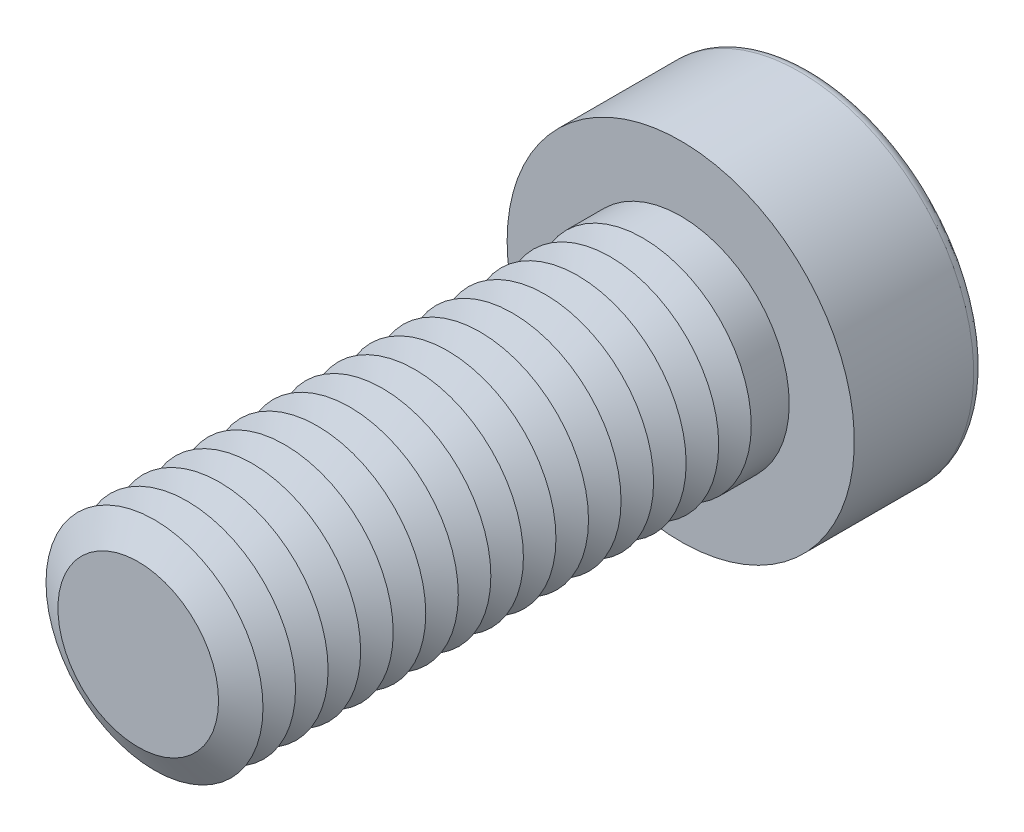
ISO-10303-21;
HEADER;
FILE_DESCRIPTION(('STEP AP214'),'2;1');
FILE_NAME('part.step','',(''),(''),'','','');
FILE_SCHEMA(('AUTOMOTIVE_DESIGN { 1 0 10303 214 1 1 1 1 }'));
ENDSEC;
DATA;
#1=APPLICATION_CONTEXT('core data for automotive mechanical design processes');
#2=APPLICATION_PROTOCOL_DEFINITION('international standard','automotive_design',2000,#1);
#3=PRODUCT_CONTEXT('',#1,'mechanical');
#4=PRODUCT('Part','Part','',(#3));
#5=PRODUCT_RELATED_PRODUCT_CATEGORY('part','',(#4));
#6=PRODUCT_DEFINITION_FORMATION('','',#4);
#7=PRODUCT_DEFINITION_CONTEXT('part definition',#1,'design');
#8=PRODUCT_DEFINITION('design','',#6,#7);
#9=PRODUCT_DEFINITION_SHAPE('','',#8);
#10=(LENGTH_UNIT() NAMED_UNIT(*) SI_UNIT(.MILLI.,.METRE.));
#11=(NAMED_UNIT(*) PLANE_ANGLE_UNIT() SI_UNIT($,.RADIAN.));
#12=(NAMED_UNIT(*) SI_UNIT($,.STERADIAN.) SOLID_ANGLE_UNIT());
#13=UNCERTAINTY_MEASURE_WITH_UNIT(LENGTH_MEASURE(1.E-05),#10,'distance_accuracy_value','');
#14=(GEOMETRIC_REPRESENTATION_CONTEXT(3) GLOBAL_UNCERTAINTY_ASSIGNED_CONTEXT((#13)) GLOBAL_UNIT_ASSIGNED_CONTEXT((#10,
#11,#12)) REPRESENTATION_CONTEXT('',''));
#15=CARTESIAN_POINT('',(0.,0.,0.));
#16=DIRECTION('',(0.,0.,1.));
#17=DIRECTION('',(1.,0.,0.));
#18=AXIS2_PLACEMENT_3D('',#15,#16,#17);
#19=CARTESIAN_POINT('',(0.,0.,19.75));
#20=DIRECTION('',(0.,0.,1.));
#21=DIRECTION('',(1.,0.,0.));
#22=AXIS2_PLACEMENT_3D('',#19,#20,#21);
#23=CONICAL_SURFACE('',#22,5.,1.0471975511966);
#24=CARTESIAN_POINT('',(0.,0.,19.));
#25=DIRECTION('',(0.,0.,1.));
#26=DIRECTION('',(1.,0.,0.));
#27=AXIS2_PLACEMENT_3D('',#24,#25,#26);
#28=CIRCLE('',#27,3.70096189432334);
#29=CARTESIAN_POINT('',(3.70096189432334,0.,19.));
#30=VERTEX_POINT('',#29);
#31=EDGE_CURVE('E313',#30,#30,#28,.T.);
#32=ORIENTED_EDGE('',*,*,#31,.T.);
#33=EDGE_LOOP('',(#32));
#34=FACE_BOUND('',#33,.T.);
#35=CARTESIAN_POINT('',(0.,0.,19.75));
#36=DIRECTION('',(0.,0.,1.));
#37=DIRECTION('',(1.,0.,0.));
#38=AXIS2_PLACEMENT_3D('',#35,#36,#37);
#39=CIRCLE('',#38,5.);
#40=CARTESIAN_POINT('',(5.,0.,19.75));
#41=VERTEX_POINT('',#40);
#42=EDGE_CURVE('E316',#41,#41,#39,.T.);
#43=ORIENTED_EDGE('',*,*,#42,.F.);
#44=EDGE_LOOP('',(#43));
#45=FACE_BOUND('',#44,.T.);
#46=ADVANCED_FACE('F38',(#34,#45),#23,.T.);
#47=CARTESIAN_POINT('',(0.,0.,19.));
#48=DIRECTION('',(0.,0.,-1.));
#49=DIRECTION('',(-1.,0.,0.));
#50=AXIS2_PLACEMENT_3D('',#47,#48,#49);
#51=CONICAL_SURFACE('',#50,3.70096189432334,1.0471975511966);
#52=CARTESIAN_POINT('',(0.,0.,18.25));
#53=DIRECTION('',(0.,0.,1.));
#54=DIRECTION('',(1.,0.,0.));
#55=AXIS2_PLACEMENT_3D('',#52,#53,#54);
#56=CIRCLE('',#55,5.);
#57=CARTESIAN_POINT('',(5.,0.,18.25));
#58=VERTEX_POINT('',#57);
#59=EDGE_CURVE('E324',#58,#58,#56,.T.);
#60=ORIENTED_EDGE('',*,*,#59,.T.);
#61=EDGE_LOOP('',(#60));
#62=FACE_BOUND('',#61,.T.);
#63=ORIENTED_EDGE('',*,*,#31,.F.);
#64=EDGE_LOOP('',(#63));
#65=FACE_BOUND('',#64,.T.);
#66=ADVANCED_FACE('F244',(#62,#65),#51,.T.);
#67=CARTESIAN_POINT('',(0.,0.,25.));
#68=DIRECTION('',(0.,0.,1.));
#69=DIRECTION('',(1.,0.,0.));
#70=AXIS2_PLACEMENT_3D('',#67,#68,#69);
#71=PLANE('',#70);
#72=CARTESIAN_POINT('',(0.,0.,25.));
#73=DIRECTION('',(0.,0.,1.));
#74=DIRECTION('',(1.,0.,0.));
#75=AXIS2_PLACEMENT_3D('',#72,#73,#74);
#76=CIRCLE('',#75,3.70096189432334);
#77=CARTESIAN_POINT('',(3.70096189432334,0.,25.));
#78=VERTEX_POINT('',#77);
#79=EDGE_CURVE('E173',#78,#78,#76,.T.);
#80=ORIENTED_EDGE('',*,*,#79,.T.);
#81=EDGE_LOOP('',(#80));
#82=FACE_BOUND('',#81,.T.);
#83=ADVANCED_FACE('F250',(#82),#71,.T.);
#84=CARTESIAN_POINT('',(0.,0.,25.));
#85=DIRECTION('',(0.,0.,-1.));
#86=DIRECTION('',(-1.,0.,0.));
#87=AXIS2_PLACEMENT_3D('',#84,#85,#86);
#88=CONICAL_SURFACE('',#87,3.70096189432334,1.0471975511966);
#89=CARTESIAN_POINT('',(0.,0.,24.25));
#90=DIRECTION('',(0.,0.,1.));
#91=DIRECTION('',(1.,0.,0.));
#92=AXIS2_PLACEMENT_3D('',#89,#90,#91);
#93=CIRCLE('',#92,5.);
#94=CARTESIAN_POINT('',(5.,0.,24.25));
#95=VERTEX_POINT('',#94);
#96=EDGE_CURVE('E290',#95,#95,#93,.T.);
#97=ORIENTED_EDGE('',*,*,#96,.T.);
#98=EDGE_LOOP('',(#97));
#99=FACE_BOUND('',#98,.T.);
#100=ORIENTED_EDGE('',*,*,#79,.F.);
#101=EDGE_LOOP('',(#100));
#102=FACE_BOUND('',#101,.T.);
#103=ADVANCED_FACE('F198',(#99,#102),#88,.T.);
#104=CARTESIAN_POINT('',(0.,0.,24.25));
#105=DIRECTION('',(0.,0.,1.));
#106=DIRECTION('',(1.,0.,0.));
#107=AXIS2_PLACEMENT_3D('',#104,#105,#106);
#108=CONICAL_SURFACE('',#107,5.,1.0471975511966);
#109=CARTESIAN_POINT('',(0.,0.,23.5));
#110=DIRECTION('',(0.,0.,1.));
#111=DIRECTION('',(1.,0.,0.));
#112=AXIS2_PLACEMENT_3D('',#109,#110,#111);
#113=CIRCLE('',#112,3.70096189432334);
#114=CARTESIAN_POINT('',(3.70096189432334,0.,23.5));
#115=VERTEX_POINT('',#114);
#116=EDGE_CURVE('E287',#115,#115,#113,.T.);
#117=ORIENTED_EDGE('',*,*,#116,.T.);
#118=EDGE_LOOP('',(#117));
#119=FACE_BOUND('',#118,.T.);
#120=ORIENTED_EDGE('',*,*,#96,.F.);
#121=EDGE_LOOP('',(#120));
#122=FACE_BOUND('',#121,.T.);
#123=ADVANCED_FACE('F276',(#119,#122),#108,.T.);
#124=CARTESIAN_POINT('',(0.,0.,23.5));
#125=DIRECTION('',(0.,0.,-1.));
#126=DIRECTION('',(-1.,0.,0.));
#127=AXIS2_PLACEMENT_3D('',#124,#125,#126);
#128=CONICAL_SURFACE('',#127,3.70096189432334,1.0471975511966);
#129=CARTESIAN_POINT('',(0.,0.,22.75));
#130=DIRECTION('',(0.,0.,1.));
#131=DIRECTION('',(1.,0.,0.));
#132=AXIS2_PLACEMENT_3D('',#129,#130,#131);
#133=CIRCLE('',#132,5.);
#134=CARTESIAN_POINT('',(5.,0.,22.75));
#135=VERTEX_POINT('',#134);
#136=EDGE_CURVE('E299',#135,#135,#133,.T.);
#137=ORIENTED_EDGE('',*,*,#136,.T.);
#138=EDGE_LOOP('',(#137));
#139=FACE_BOUND('',#138,.T.);
#140=ORIENTED_EDGE('',*,*,#116,.F.);
#141=EDGE_LOOP('',(#140));
#142=FACE_BOUND('',#141,.T.);
#143=ADVANCED_FACE('F273',(#139,#142),#128,.T.);
#144=CARTESIAN_POINT('',(0.,0.,22.75));
#145=DIRECTION('',(0.,0.,1.));
#146=DIRECTION('',(1.,0.,0.));
#147=AXIS2_PLACEMENT_3D('',#144,#145,#146);
#148=CONICAL_SURFACE('',#147,5.,1.0471975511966);
#149=CARTESIAN_POINT('',(0.,0.,22.));
#150=DIRECTION('',(0.,0.,1.));
#151=DIRECTION('',(1.,0.,0.));
#152=AXIS2_PLACEMENT_3D('',#149,#150,#151);
#153=CIRCLE('',#152,3.70096189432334);
#154=CARTESIAN_POINT('',(3.70096189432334,0.,22.));
#155=VERTEX_POINT('',#154);
#156=EDGE_CURVE('E292',#155,#155,#153,.T.);
#157=ORIENTED_EDGE('',*,*,#156,.T.);
#158=EDGE_LOOP('',(#157));
#159=FACE_BOUND('',#158,.T.);
#160=ORIENTED_EDGE('',*,*,#136,.F.);
#161=EDGE_LOOP('',(#160));
#162=FACE_BOUND('',#161,.T.);
#163=ADVANCED_FACE('F269',(#159,#162),#148,.T.);
#164=CARTESIAN_POINT('',(0.,0.,22.));
#165=DIRECTION('',(0.,0.,-1.));
#166=DIRECTION('',(-1.,0.,0.));
#167=AXIS2_PLACEMENT_3D('',#164,#165,#166);
#168=CONICAL_SURFACE('',#167,3.70096189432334,1.0471975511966);
#169=CARTESIAN_POINT('',(0.,0.,21.25));
#170=DIRECTION('',(0.,0.,1.));
#171=DIRECTION('',(1.,0.,0.));
#172=AXIS2_PLACEMENT_3D('',#169,#170,#171);
#173=CIRCLE('',#172,5.);
#174=CARTESIAN_POINT('',(5.,0.,21.25));
#175=VERTEX_POINT('',#174);
#176=EDGE_CURVE('E309',#175,#175,#173,.T.);
#177=ORIENTED_EDGE('',*,*,#176,.T.);
#178=EDGE_LOOP('',(#177));
#179=FACE_BOUND('',#178,.T.);
#180=ORIENTED_EDGE('',*,*,#156,.F.);
#181=EDGE_LOOP('',(#180));
#182=FACE_BOUND('',#181,.T.);
#183=ADVANCED_FACE('F265',(#179,#182),#168,.T.);
#184=CARTESIAN_POINT('',(0.,0.,21.25));
#185=DIRECTION('',(0.,0.,1.));
#186=DIRECTION('',(1.,0.,0.));
#187=AXIS2_PLACEMENT_3D('',#184,#185,#186);
#188=CONICAL_SURFACE('',#187,5.,1.0471975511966);
#189=CARTESIAN_POINT('',(0.,0.,20.5));
#190=DIRECTION('',(0.,0.,1.));
#191=DIRECTION('',(1.,0.,0.));
#192=AXIS2_PLACEMENT_3D('',#189,#190,#191);
#193=CIRCLE('',#192,3.70096189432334);
#194=CARTESIAN_POINT('',(3.70096189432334,0.,20.5));
#195=VERTEX_POINT('',#194);
#196=EDGE_CURVE('E305',#195,#195,#193,.T.);
#197=ORIENTED_EDGE('',*,*,#196,.T.);
#198=EDGE_LOOP('',(#197));
#199=FACE_BOUND('',#198,.T.);
#200=ORIENTED_EDGE('',*,*,#176,.F.);
#201=EDGE_LOOP('',(#200));
#202=FACE_BOUND('',#201,.T.);
#203=ADVANCED_FACE('F261',(#199,#202),#188,.T.);
#204=CARTESIAN_POINT('',(0.,0.,20.5));
#205=DIRECTION('',(0.,0.,-1.));
#206=DIRECTION('',(-1.,0.,0.));
#207=AXIS2_PLACEMENT_3D('',#204,#205,#206);
#208=CONICAL_SURFACE('',#207,3.70096189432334,1.0471975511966);
#209=ORIENTED_EDGE('',*,*,#42,.T.);
#210=EDGE_LOOP('',(#209));
#211=FACE_BOUND('',#210,.T.);
#212=ORIENTED_EDGE('',*,*,#196,.F.);
#213=EDGE_LOOP('',(#212));
#214=FACE_BOUND('',#213,.T.);
#215=ADVANCED_FACE('F257',(#211,#214),#208,.T.);
#216=CARTESIAN_POINT('',(0.,0.,18.25));
#217=DIRECTION('',(0.,0.,1.));
#218=DIRECTION('',(1.,0.,0.));
#219=AXIS2_PLACEMENT_3D('',#216,#217,#218);
#220=CONICAL_SURFACE('',#219,5.,1.0471975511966);
#221=CARTESIAN_POINT('',(0.,0.,17.5));
#222=DIRECTION('',(0.,0.,1.));
#223=DIRECTION('',(1.,0.,0.));
#224=AXIS2_PLACEMENT_3D('',#221,#222,#223);
#225=CIRCLE('',#224,3.70096189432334);
#226=CARTESIAN_POINT('',(3.70096189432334,0.,17.5));
#227=VERTEX_POINT('',#226);
#228=EDGE_CURVE('E320',#227,#227,#225,.T.);
#229=ORIENTED_EDGE('',*,*,#228,.T.);
#230=EDGE_LOOP('',(#229));
#231=FACE_BOUND('',#230,.T.);
#232=ORIENTED_EDGE('',*,*,#59,.F.);
#233=EDGE_LOOP('',(#232));
#234=FACE_BOUND('',#233,.T.);
#235=ADVANCED_FACE('F260',(#231,#234),#220,.T.);
#236=CARTESIAN_POINT('',(0.,0.,17.5));
#237=DIRECTION('',(0.,0.,-1.));
#238=DIRECTION('',(-1.,0.,0.));
#239=AXIS2_PLACEMENT_3D('',#236,#237,#238);
#240=CONICAL_SURFACE('',#239,3.70096189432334,1.0471975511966);
#241=CARTESIAN_POINT('',(0.,0.,16.75));
#242=DIRECTION('',(0.,0.,1.));
#243=DIRECTION('',(1.,0.,0.));
#244=AXIS2_PLACEMENT_3D('',#241,#242,#243);
#245=CIRCLE('',#244,5.);
#246=CARTESIAN_POINT('',(5.,0.,16.75));
#247=VERTEX_POINT('',#246);
#248=EDGE_CURVE('E332',#247,#247,#245,.T.);
#249=ORIENTED_EDGE('',*,*,#248,.T.);
#250=EDGE_LOOP('',(#249));
#251=FACE_BOUND('',#250,.T.);
#252=ORIENTED_EDGE('',*,*,#228,.F.);
#253=EDGE_LOOP('',(#252));
#254=FACE_BOUND('',#253,.T.);
#255=ADVANCED_FACE('F497',(#251,#254),#240,.T.);
#256=CARTESIAN_POINT('',(0.,0.,16.75));
#257=DIRECTION('',(0.,0.,1.));
#258=DIRECTION('',(1.,0.,0.));
#259=AXIS2_PLACEMENT_3D('',#256,#257,#258);
#260=CONICAL_SURFACE('',#259,5.,1.0471975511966);
#261=CARTESIAN_POINT('',(0.,0.,16.));
#262=DIRECTION('',(0.,0.,1.));
#263=DIRECTION('',(1.,0.,0.));
#264=AXIS2_PLACEMENT_3D('',#261,#262,#263);
#265=CIRCLE('',#264,3.70096189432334);
#266=CARTESIAN_POINT('',(3.70096189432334,0.,16.));
#267=VERTEX_POINT('',#266);
#268=EDGE_CURVE('E328',#267,#267,#265,.T.);
#269=ORIENTED_EDGE('',*,*,#268,.T.);
#270=EDGE_LOOP('',(#269));
#271=FACE_BOUND('',#270,.T.);
#272=ORIENTED_EDGE('',*,*,#248,.F.);
#273=EDGE_LOOP('',(#272));
#274=FACE_BOUND('',#273,.T.);
#275=ADVANCED_FACE('F493',(#271,#274),#260,.T.);
#276=CARTESIAN_POINT('',(0.,0.,16.));
#277=DIRECTION('',(0.,0.,-1.));
#278=DIRECTION('',(-1.,0.,0.));
#279=AXIS2_PLACEMENT_3D('',#276,#277,#278);
#280=CONICAL_SURFACE('',#279,3.70096189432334,1.0471975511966);
#281=CARTESIAN_POINT('',(0.,0.,15.25));
#282=DIRECTION('',(0.,0.,1.));
#283=DIRECTION('',(1.,0.,0.));
#284=AXIS2_PLACEMENT_3D('',#281,#282,#283);
#285=CIRCLE('',#284,5.);
#286=CARTESIAN_POINT('',(5.,0.,15.25));
#287=VERTEX_POINT('',#286);
#288=EDGE_CURVE('E340',#287,#287,#285,.T.);
#289=ORIENTED_EDGE('',*,*,#288,.T.);
#290=EDGE_LOOP('',(#289));
#291=FACE_BOUND('',#290,.T.);
#292=ORIENTED_EDGE('',*,*,#268,.F.);
#293=EDGE_LOOP('',(#292));
#294=FACE_BOUND('',#293,.T.);
#295=ADVANCED_FACE('F489',(#291,#294),#280,.T.);
#296=CARTESIAN_POINT('',(0.,0.,15.25));
#297=DIRECTION('',(0.,0.,1.));
#298=DIRECTION('',(1.,0.,0.));
#299=AXIS2_PLACEMENT_3D('',#296,#297,#298);
#300=CONICAL_SURFACE('',#299,5.,1.0471975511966);
#301=CARTESIAN_POINT('',(0.,0.,14.5));
#302=DIRECTION('',(0.,0.,1.));
#303=DIRECTION('',(1.,0.,0.));
#304=AXIS2_PLACEMENT_3D('',#301,#302,#303);
#305=CIRCLE('',#304,3.70096189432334);
#306=CARTESIAN_POINT('',(3.70096189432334,0.,14.5));
#307=VERTEX_POINT('',#306);
#308=EDGE_CURVE('E336',#307,#307,#305,.T.);
#309=ORIENTED_EDGE('',*,*,#308,.T.);
#310=EDGE_LOOP('',(#309));
#311=FACE_BOUND('',#310,.T.);
#312=ORIENTED_EDGE('',*,*,#288,.F.);
#313=EDGE_LOOP('',(#312));
#314=FACE_BOUND('',#313,.T.);
#315=ADVANCED_FACE('F485',(#311,#314),#300,.T.);
#316=CARTESIAN_POINT('',(0.,0.,14.5));
#317=DIRECTION('',(0.,0.,-1.));
#318=DIRECTION('',(-1.,0.,0.));
#319=AXIS2_PLACEMENT_3D('',#316,#317,#318);
#320=CONICAL_SURFACE('',#319,3.70096189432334,1.0471975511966);
#321=CARTESIAN_POINT('',(0.,0.,13.75));
#322=DIRECTION('',(0.,0.,1.));
#323=DIRECTION('',(1.,0.,0.));
#324=AXIS2_PLACEMENT_3D('',#321,#322,#323);
#325=CIRCLE('',#324,5.);
#326=CARTESIAN_POINT('',(5.,0.,13.75));
#327=VERTEX_POINT('',#326);
#328=EDGE_CURVE('E348',#327,#327,#325,.T.);
#329=ORIENTED_EDGE('',*,*,#328,.T.);
#330=EDGE_LOOP('',(#329));
#331=FACE_BOUND('',#330,.T.);
#332=ORIENTED_EDGE('',*,*,#308,.F.);
#333=EDGE_LOOP('',(#332));
#334=FACE_BOUND('',#333,.T.);
#335=ADVANCED_FACE('F481',(#331,#334),#320,.T.);
#336=CARTESIAN_POINT('',(0.,0.,13.75));
#337=DIRECTION('',(0.,0.,1.));
#338=DIRECTION('',(1.,0.,0.));
#339=AXIS2_PLACEMENT_3D('',#336,#337,#338);
#340=CONICAL_SURFACE('',#339,5.,1.0471975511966);
#341=CARTESIAN_POINT('',(0.,0.,13.));
#342=DIRECTION('',(0.,0.,1.));
#343=DIRECTION('',(1.,0.,0.));
#344=AXIS2_PLACEMENT_3D('',#341,#342,#343);
#345=CIRCLE('',#344,3.70096189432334);
#346=CARTESIAN_POINT('',(3.70096189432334,0.,13.));
#347=VERTEX_POINT('',#346);
#348=EDGE_CURVE('E344',#347,#347,#345,.T.);
#349=ORIENTED_EDGE('',*,*,#348,.T.);
#350=EDGE_LOOP('',(#349));
#351=FACE_BOUND('',#350,.T.);
#352=ORIENTED_EDGE('',*,*,#328,.F.);
#353=EDGE_LOOP('',(#352));
#354=FACE_BOUND('',#353,.T.);
#355=ADVANCED_FACE('F477',(#351,#354),#340,.T.);
#356=CARTESIAN_POINT('',(0.,0.,13.));
#357=DIRECTION('',(0.,0.,-1.));
#358=DIRECTION('',(-1.,0.,0.));
#359=AXIS2_PLACEMENT_3D('',#356,#357,#358);
#360=CONICAL_SURFACE('',#359,3.70096189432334,1.0471975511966);
#361=CARTESIAN_POINT('',(0.,0.,12.25));
#362=DIRECTION('',(0.,0.,1.));
#363=DIRECTION('',(1.,0.,0.));
#364=AXIS2_PLACEMENT_3D('',#361,#362,#363);
#365=CIRCLE('',#364,5.);
#366=CARTESIAN_POINT('',(5.,0.,12.25));
#367=VERTEX_POINT('',#366);
#368=EDGE_CURVE('E356',#367,#367,#365,.T.);
#369=ORIENTED_EDGE('',*,*,#368,.T.);
#370=EDGE_LOOP('',(#369));
#371=FACE_BOUND('',#370,.T.);
#372=ORIENTED_EDGE('',*,*,#348,.F.);
#373=EDGE_LOOP('',(#372));
#374=FACE_BOUND('',#373,.T.);
#375=ADVANCED_FACE('F473',(#371,#374),#360,.T.);
#376=CARTESIAN_POINT('',(0.,0.,12.25));
#377=DIRECTION('',(0.,0.,1.));
#378=DIRECTION('',(1.,0.,0.));
#379=AXIS2_PLACEMENT_3D('',#376,#377,#378);
#380=CONICAL_SURFACE('',#379,5.,1.0471975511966);
#381=CARTESIAN_POINT('',(0.,0.,11.5));
#382=DIRECTION('',(0.,0.,1.));
#383=DIRECTION('',(1.,0.,0.));
#384=AXIS2_PLACEMENT_3D('',#381,#382,#383);
#385=CIRCLE('',#384,3.70096189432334);
#386=CARTESIAN_POINT('',(3.70096189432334,0.,11.5));
#387=VERTEX_POINT('',#386);
#388=EDGE_CURVE('E352',#387,#387,#385,.T.);
#389=ORIENTED_EDGE('',*,*,#388,.T.);
#390=EDGE_LOOP('',(#389));
#391=FACE_BOUND('',#390,.T.);
#392=ORIENTED_EDGE('',*,*,#368,.F.);
#393=EDGE_LOOP('',(#392));
#394=FACE_BOUND('',#393,.T.);
#395=ADVANCED_FACE('F469',(#391,#394),#380,.T.);
#396=CARTESIAN_POINT('',(0.,0.,11.5));
#397=DIRECTION('',(0.,0.,-1.));
#398=DIRECTION('',(-1.,0.,0.));
#399=AXIS2_PLACEMENT_3D('',#396,#397,#398);
#400=CONICAL_SURFACE('',#399,3.70096189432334,1.0471975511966);
#401=CARTESIAN_POINT('',(0.,0.,10.75));
#402=DIRECTION('',(0.,0.,1.));
#403=DIRECTION('',(1.,0.,0.));
#404=AXIS2_PLACEMENT_3D('',#401,#402,#403);
#405=CIRCLE('',#404,5.);
#406=CARTESIAN_POINT('',(5.,0.,10.75));
#407=VERTEX_POINT('',#406);
#408=EDGE_CURVE('E364',#407,#407,#405,.T.);
#409=ORIENTED_EDGE('',*,*,#408,.T.);
#410=EDGE_LOOP('',(#409));
#411=FACE_BOUND('',#410,.T.);
#412=ORIENTED_EDGE('',*,*,#388,.F.);
#413=EDGE_LOOP('',(#412));
#414=FACE_BOUND('',#413,.T.);
#415=ADVANCED_FACE('F465',(#411,#414),#400,.T.);
#416=CARTESIAN_POINT('',(0.,0.,10.75));
#417=DIRECTION('',(0.,0.,1.));
#418=DIRECTION('',(1.,0.,0.));
#419=AXIS2_PLACEMENT_3D('',#416,#417,#418);
#420=CONICAL_SURFACE('',#419,5.,1.0471975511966);
#421=CARTESIAN_POINT('',(0.,0.,10.));
#422=DIRECTION('',(0.,0.,1.));
#423=DIRECTION('',(1.,0.,0.));
#424=AXIS2_PLACEMENT_3D('',#421,#422,#423);
#425=CIRCLE('',#424,3.70096189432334);
#426=CARTESIAN_POINT('',(3.70096189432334,0.,10.));
#427=VERTEX_POINT('',#426);
#428=EDGE_CURVE('E360',#427,#427,#425,.T.);
#429=ORIENTED_EDGE('',*,*,#428,.T.);
#430=EDGE_LOOP('',(#429));
#431=FACE_BOUND('',#430,.T.);
#432=ORIENTED_EDGE('',*,*,#408,.F.);
#433=EDGE_LOOP('',(#432));
#434=FACE_BOUND('',#433,.T.);
#435=ADVANCED_FACE('F461',(#431,#434),#420,.T.);
#436=CARTESIAN_POINT('',(0.,0.,10.));
#437=DIRECTION('',(0.,0.,-1.));
#438=DIRECTION('',(-1.,0.,0.));
#439=AXIS2_PLACEMENT_3D('',#436,#437,#438);
#440=CONICAL_SURFACE('',#439,3.70096189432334,1.0471975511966);
#441=CARTESIAN_POINT('',(0.,0.,9.25));
#442=DIRECTION('',(0.,0.,1.));
#443=DIRECTION('',(1.,0.,0.));
#444=AXIS2_PLACEMENT_3D('',#441,#442,#443);
#445=CIRCLE('',#444,5.);
#446=CARTESIAN_POINT('',(5.,0.,9.25));
#447=VERTEX_POINT('',#446);
#448=EDGE_CURVE('E372',#447,#447,#445,.T.);
#449=ORIENTED_EDGE('',*,*,#448,.T.);
#450=EDGE_LOOP('',(#449));
#451=FACE_BOUND('',#450,.T.);
#452=ORIENTED_EDGE('',*,*,#428,.F.);
#453=EDGE_LOOP('',(#452));
#454=FACE_BOUND('',#453,.T.);
#455=ADVANCED_FACE('F457',(#451,#454),#440,.T.);
#456=CARTESIAN_POINT('',(0.,0.,9.25));
#457=DIRECTION('',(0.,0.,1.));
#458=DIRECTION('',(1.,0.,0.));
#459=AXIS2_PLACEMENT_3D('',#456,#457,#458);
#460=CONICAL_SURFACE('',#459,5.,1.0471975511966);
#461=CARTESIAN_POINT('',(0.,0.,8.5));
#462=DIRECTION('',(0.,0.,1.));
#463=DIRECTION('',(1.,0.,0.));
#464=AXIS2_PLACEMENT_3D('',#461,#462,#463);
#465=CIRCLE('',#464,3.70096189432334);
#466=CARTESIAN_POINT('',(3.70096189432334,0.,8.5));
#467=VERTEX_POINT('',#466);
#468=EDGE_CURVE('E368',#467,#467,#465,.T.);
#469=ORIENTED_EDGE('',*,*,#468,.T.);
#470=EDGE_LOOP('',(#469));
#471=FACE_BOUND('',#470,.T.);
#472=ORIENTED_EDGE('',*,*,#448,.F.);
#473=EDGE_LOOP('',(#472));
#474=FACE_BOUND('',#473,.T.);
#475=ADVANCED_FACE('F453',(#471,#474),#460,.T.);
#476=CARTESIAN_POINT('',(0.,0.,8.5));
#477=DIRECTION('',(0.,0.,-1.));
#478=DIRECTION('',(-1.,0.,0.));
#479=AXIS2_PLACEMENT_3D('',#476,#477,#478);
#480=CONICAL_SURFACE('',#479,3.70096189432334,1.0471975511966);
#481=CARTESIAN_POINT('',(0.,0.,7.75));
#482=DIRECTION('',(0.,0.,1.));
#483=DIRECTION('',(1.,0.,0.));
#484=AXIS2_PLACEMENT_3D('',#481,#482,#483);
#485=CIRCLE('',#484,5.);
#486=CARTESIAN_POINT('',(5.,0.,7.75));
#487=VERTEX_POINT('',#486);
#488=EDGE_CURVE('E380',#487,#487,#485,.T.);
#489=ORIENTED_EDGE('',*,*,#488,.T.);
#490=EDGE_LOOP('',(#489));
#491=FACE_BOUND('',#490,.T.);
#492=ORIENTED_EDGE('',*,*,#468,.F.);
#493=EDGE_LOOP('',(#492));
#494=FACE_BOUND('',#493,.T.);
#495=ADVANCED_FACE('F449',(#491,#494),#480,.T.);
#496=CARTESIAN_POINT('',(0.,0.,7.75));
#497=DIRECTION('',(0.,0.,1.));
#498=DIRECTION('',(1.,0.,0.));
#499=AXIS2_PLACEMENT_3D('',#496,#497,#498);
#500=CONICAL_SURFACE('',#499,5.,1.0471975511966);
#501=CARTESIAN_POINT('',(0.,0.,7.));
#502=DIRECTION('',(0.,0.,1.));
#503=DIRECTION('',(1.,0.,0.));
#504=AXIS2_PLACEMENT_3D('',#501,#502,#503);
#505=CIRCLE('',#504,3.70096189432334);
#506=CARTESIAN_POINT('',(3.70096189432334,0.,7.));
#507=VERTEX_POINT('',#506);
#508=EDGE_CURVE('E376',#507,#507,#505,.T.);
#509=ORIENTED_EDGE('',*,*,#508,.T.);
#510=EDGE_LOOP('',(#509));
#511=FACE_BOUND('',#510,.T.);
#512=ORIENTED_EDGE('',*,*,#488,.F.);
#513=EDGE_LOOP('',(#512));
#514=FACE_BOUND('',#513,.T.);
#515=ADVANCED_FACE('F445',(#511,#514),#500,.T.);
#516=CARTESIAN_POINT('',(0.,0.,7.));
#517=DIRECTION('',(0.,0.,-1.));
#518=DIRECTION('',(-1.,0.,0.));
#519=AXIS2_PLACEMENT_3D('',#516,#517,#518);
#520=CONICAL_SURFACE('',#519,3.70096189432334,1.0471975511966);
#521=CARTESIAN_POINT('',(0.,0.,6.25));
#522=DIRECTION('',(0.,0.,1.));
#523=DIRECTION('',(1.,0.,0.));
#524=AXIS2_PLACEMENT_3D('',#521,#522,#523);
#525=CIRCLE('',#524,5.);
#526=CARTESIAN_POINT('',(5.,0.,6.25));
#527=VERTEX_POINT('',#526);
#528=EDGE_CURVE('E388',#527,#527,#525,.T.);
#529=ORIENTED_EDGE('',*,*,#528,.T.);
#530=EDGE_LOOP('',(#529));
#531=FACE_BOUND('',#530,.T.);
#532=ORIENTED_EDGE('',*,*,#508,.F.);
#533=EDGE_LOOP('',(#532));
#534=FACE_BOUND('',#533,.T.);
#535=ADVANCED_FACE('F441',(#531,#534),#520,.T.);
#536=CARTESIAN_POINT('',(0.,0.,6.25));
#537=DIRECTION('',(0.,0.,1.));
#538=DIRECTION('',(1.,0.,0.));
#539=AXIS2_PLACEMENT_3D('',#536,#537,#538);
#540=CONICAL_SURFACE('',#539,5.,1.0471975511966);
#541=CARTESIAN_POINT('',(0.,0.,5.5));
#542=DIRECTION('',(0.,0.,1.));
#543=DIRECTION('',(1.,0.,0.));
#544=AXIS2_PLACEMENT_3D('',#541,#542,#543);
#545=CIRCLE('',#544,3.70096189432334);
#546=CARTESIAN_POINT('',(3.70096189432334,0.,5.5));
#547=VERTEX_POINT('',#546);
#548=EDGE_CURVE('E384',#547,#547,#545,.T.);
#549=ORIENTED_EDGE('',*,*,#548,.T.);
#550=EDGE_LOOP('',(#549));
#551=FACE_BOUND('',#550,.T.);
#552=ORIENTED_EDGE('',*,*,#528,.F.);
#553=EDGE_LOOP('',(#552));
#554=FACE_BOUND('',#553,.T.);
#555=ADVANCED_FACE('F437',(#551,#554),#540,.T.);
#556=CARTESIAN_POINT('',(0.,0.,5.5));
#557=DIRECTION('',(0.,0.,-1.));
#558=DIRECTION('',(-1.,0.,0.));
#559=AXIS2_PLACEMENT_3D('',#556,#557,#558);
#560=CONICAL_SURFACE('',#559,3.70096189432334,1.0471975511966);
#561=CARTESIAN_POINT('',(0.,0.,4.75));
#562=DIRECTION('',(0.,0.,1.));
#563=DIRECTION('',(1.,0.,0.));
#564=AXIS2_PLACEMENT_3D('',#561,#562,#563);
#565=CIRCLE('',#564,5.);
#566=CARTESIAN_POINT('',(5.,0.,4.75));
#567=VERTEX_POINT('',#566);
#568=EDGE_CURVE('E396',#567,#567,#565,.T.);
#569=ORIENTED_EDGE('',*,*,#568,.T.);
#570=EDGE_LOOP('',(#569));
#571=FACE_BOUND('',#570,.T.);
#572=ORIENTED_EDGE('',*,*,#548,.F.);
#573=EDGE_LOOP('',(#572));
#574=FACE_BOUND('',#573,.T.);
#575=ADVANCED_FACE('F433',(#571,#574),#560,.T.);
#576=CARTESIAN_POINT('',(0.,0.,4.75));
#577=DIRECTION('',(0.,0.,1.));
#578=DIRECTION('',(1.,0.,0.));
#579=AXIS2_PLACEMENT_3D('',#576,#577,#578);
#580=CONICAL_SURFACE('',#579,5.,1.0471975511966);
#581=CARTESIAN_POINT('',(0.,0.,4.));
#582=DIRECTION('',(0.,0.,1.));
#583=DIRECTION('',(1.,0.,0.));
#584=AXIS2_PLACEMENT_3D('',#581,#582,#583);
#585=CIRCLE('',#584,3.70096189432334);
#586=CARTESIAN_POINT('',(3.70096189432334,0.,4.));
#587=VERTEX_POINT('',#586);
#588=EDGE_CURVE('E392',#587,#587,#585,.T.);
#589=ORIENTED_EDGE('',*,*,#588,.T.);
#590=EDGE_LOOP('',(#589));
#591=FACE_BOUND('',#590,.T.);
#592=ORIENTED_EDGE('',*,*,#568,.F.);
#593=EDGE_LOOP('',(#592));
#594=FACE_BOUND('',#593,.T.);
#595=ADVANCED_FACE('F428',(#591,#594),#580,.T.);
#596=CARTESIAN_POINT('',(0.,0.,4.));
#597=DIRECTION('',(0.,0.,-1.));
#598=DIRECTION('',(-1.,0.,0.));
#599=AXIS2_PLACEMENT_3D('',#596,#597,#598);
#600=CONICAL_SURFACE('',#599,3.70096189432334,1.0471975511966);
#601=CARTESIAN_POINT('',(0.,0.,3.25));
#602=DIRECTION('',(0.,0.,1.));
#603=DIRECTION('',(1.,0.,0.));
#604=AXIS2_PLACEMENT_3D('',#601,#602,#603);
#605=CIRCLE('',#604,5.);
#606=CARTESIAN_POINT('',(5.,0.,3.25));
#607=VERTEX_POINT('',#606);
#608=EDGE_CURVE('E408',#607,#607,#605,.T.);
#609=ORIENTED_EDGE('',*,*,#608,.T.);
#610=EDGE_LOOP('',(#609));
#611=FACE_BOUND('',#610,.T.);
#612=ORIENTED_EDGE('',*,*,#588,.F.);
#613=EDGE_LOOP('',(#612));
#614=FACE_BOUND('',#613,.T.);
#615=ADVANCED_FACE('F414',(#611,#614),#600,.T.);
#616=CARTESIAN_POINT('',(0.,0.,3.25));
#617=DIRECTION('',(0.,0.,1.));
#618=DIRECTION('',(1.,0.,0.));
#619=AXIS2_PLACEMENT_3D('',#616,#617,#618);
#620=CONICAL_SURFACE('',#619,5.,1.0471975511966);
#621=CARTESIAN_POINT('',(0.,0.,2.5));
#622=DIRECTION('',(0.,0.,1.));
#623=DIRECTION('',(1.,0.,0.));
#624=AXIS2_PLACEMENT_3D('',#621,#622,#623);
#625=CIRCLE('',#624,3.70096189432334);
#626=CARTESIAN_POINT('',(3.70096189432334,0.,2.5));
#627=VERTEX_POINT('',#626);
#628=EDGE_CURVE('E400',#627,#627,#625,.T.);
#629=ORIENTED_EDGE('',*,*,#628,.T.);
#630=EDGE_LOOP('',(#629));
#631=FACE_BOUND('',#630,.T.);
#632=ORIENTED_EDGE('',*,*,#608,.F.);
#633=EDGE_LOOP('',(#632));
#634=FACE_BOUND('',#633,.T.);
#635=ADVANCED_FACE('F417',(#631,#634),#620,.T.);
#636=CARTESIAN_POINT('',(0.,0.,2.5));
#637=DIRECTION('',(0.,0.,-1.));
#638=DIRECTION('',(-1.,0.,0.));
#639=AXIS2_PLACEMENT_3D('',#636,#637,#638);
#640=CONICAL_SURFACE('',#639,3.70096189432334,1.0471975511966);
#641=CARTESIAN_POINT('',(0.,0.,1.75));
#642=DIRECTION('',(0.,0.,1.));
#643=DIRECTION('',(1.,0.,0.));
#644=AXIS2_PLACEMENT_3D('',#641,#642,#643);
#645=CIRCLE('',#644,5.);
#646=CARTESIAN_POINT('',(5.,0.,1.75));
#647=VERTEX_POINT('',#646);
#648=EDGE_CURVE('E404',#647,#647,#645,.T.);
#649=ORIENTED_EDGE('',*,*,#648,.T.);
#650=EDGE_LOOP('',(#649));
#651=FACE_BOUND('',#650,.T.);
#652=ORIENTED_EDGE('',*,*,#628,.F.);
#653=EDGE_LOOP('',(#652));
#654=FACE_BOUND('',#653,.T.);
#655=ADVANCED_FACE('F419',(#651,#654),#640,.T.);
#656=CARTESIAN_POINT('',(0.,0.,-0.75));
#657=DIRECTION('',(0.,0.,-1.));
#658=DIRECTION('',(-1.,0.,0.));
#659=AXIS2_PLACEMENT_3D('',#656,#657,#658);
#660=CONICAL_SURFACE('',#659,3.5,1.0471975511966);
#661=CARTESIAN_POINT('',(0.,0.,1.27072594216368));
#662=VERTEX_POINT('',#661);
#663=VERTEX_LOOP('',#662);
#664=FACE_BOUND('',#663,.T.);
#665=CARTESIAN_POINT('',(0.,0.,-0.75));
#666=DIRECTION('',(0.,0.,-1.));
#667=DIRECTION('',(-1.,0.,0.));
#668=AXIS2_PLACEMENT_3D('',#665,#666,#667);
#669=CIRCLE('',#668,3.5);
#670=CARTESIAN_POINT('',(-3.03108891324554,1.75,-0.75));
#671=VERTEX_POINT('',#670);
#672=CARTESIAN_POINT('',(0.,3.5,-0.75));
#673=VERTEX_POINT('',#672);
#674=EDGE_CURVE('E148',#671,#673,#669,.T.);
#675=ORIENTED_EDGE('',*,*,#674,.T.);
#676=CARTESIAN_POINT('',(0.,0.,-0.75));
#677=DIRECTION('',(0.,0.,-1.));
#678=DIRECTION('',(-1.,0.,0.));
#679=AXIS2_PLACEMENT_3D('',#676,#677,#678);
#680=CIRCLE('',#679,3.5);
#681=CARTESIAN_POINT('',(3.03108891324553,1.75,-0.75));
#682=VERTEX_POINT('',#681);
#683=EDGE_CURVE('E53',#673,#682,#680,.T.);
#684=ORIENTED_EDGE('',*,*,#683,.T.);
#685=CARTESIAN_POINT('',(3.03108891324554,-1.75,-0.75));
#686=VERTEX_POINT('',#685);
#687=EDGE_CURVE('E1000',#682,#686,#680,.T.);
#688=ORIENTED_EDGE('',*,*,#687,.T.);
#689=CARTESIAN_POINT('',(0.,-3.5,-0.75));
#690=VERTEX_POINT('',#689);
#691=EDGE_CURVE('E998',#686,#690,#680,.T.);
#692=ORIENTED_EDGE('',*,*,#691,.T.);
#693=CARTESIAN_POINT('',(-3.03108891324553,-1.75,-0.75));
#694=VERTEX_POINT('',#693);
#695=EDGE_CURVE('E992',#690,#694,#680,.T.);
#696=ORIENTED_EDGE('',*,*,#695,.T.);
#697=EDGE_CURVE('E990',#694,#671,#680,.T.);
#698=ORIENTED_EDGE('',*,*,#697,.T.);
#699=EDGE_LOOP('',(#675,#684,#688,#692,#696,#698));
#700=FACE_BOUND('',#699,.T.);
#701=ADVANCED_FACE('F200',(#664,#700),#660,.F.);
#702=CARTESIAN_POINT('',(0.,0.,-0.75));
#703=DIRECTION('',(0.,0.,-1.));
#704=DIRECTION('',(-1.,0.,0.));
#705=AXIS2_PLACEMENT_3D('',#702,#703,#704);
#706=PLANE('',#705);
#707=ORIENTED_EDGE('',*,*,#683,.F.);
#708=DIRECTION('',(1.,0.,0.));
#709=VECTOR('',#708,1.);
#710=CARTESIAN_POINT('',(-2.02072594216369,3.5,-0.75));
#711=LINE('',#710,#709);
#712=CARTESIAN_POINT('',(2.02072594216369,3.5,-0.75));
#713=VERTEX_POINT('',#712);
#714=EDGE_CURVE('E1039',#673,#713,#711,.T.);
#715=ORIENTED_EDGE('',*,*,#714,.T.);
#716=DIRECTION('',(0.5,-0.866025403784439,0.));
#717=VECTOR('',#716,1.);
#718=CARTESIAN_POINT('',(2.02072594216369,3.5,-0.75));
#719=LINE('',#718,#717);
#720=EDGE_CURVE('E154',#713,#682,#719,.T.);
#721=ORIENTED_EDGE('',*,*,#720,.T.);
#722=EDGE_LOOP('',(#707,#715,#721));
#723=FACE_BOUND('',#722,.T.);
#724=ADVANCED_FACE('F586',(#723),#706,.T.);
#725=ORIENTED_EDGE('',*,*,#687,.F.);
#726=CARTESIAN_POINT('',(4.04145188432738,0.,-0.75));
#727=VERTEX_POINT('',#726);
#728=EDGE_CURVE('E1033',#682,#727,#719,.T.);
#729=ORIENTED_EDGE('',*,*,#728,.T.);
#730=DIRECTION('',(-0.5,-0.866025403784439,0.));
#731=VECTOR('',#730,1.);
#732=CARTESIAN_POINT('',(4.04145188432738,0.,-0.75));
#733=LINE('',#732,#731);
#734=EDGE_CURVE('E1011',#727,#686,#733,.T.);
#735=ORIENTED_EDGE('',*,*,#734,.T.);
#736=EDGE_LOOP('',(#725,#729,#735));
#737=FACE_BOUND('',#736,.T.);
#738=ADVANCED_FACE('F596',(#737),#706,.T.);
#739=ORIENTED_EDGE('',*,*,#691,.F.);
#740=CARTESIAN_POINT('',(2.02072594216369,-3.5,-0.75));
#741=VERTEX_POINT('',#740);
#742=EDGE_CURVE('E1013',#686,#741,#733,.T.);
#743=ORIENTED_EDGE('',*,*,#742,.T.);
#744=DIRECTION('',(-1.,0.,0.));
#745=VECTOR('',#744,1.);
#746=CARTESIAN_POINT('',(2.02072594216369,-3.5,-0.75));
#747=LINE('',#746,#745);
#748=EDGE_CURVE('E963',#741,#690,#747,.T.);
#749=ORIENTED_EDGE('',*,*,#748,.T.);
#750=EDGE_LOOP('',(#739,#743,#749));
#751=FACE_BOUND('',#750,.T.);
#752=ADVANCED_FACE('F606',(#751),#706,.T.);
#753=ORIENTED_EDGE('',*,*,#695,.F.);
#754=CARTESIAN_POINT('',(-2.02072594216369,-3.5,-0.75));
#755=VERTEX_POINT('',#754);
#756=EDGE_CURVE('E1008',#690,#755,#747,.T.);
#757=ORIENTED_EDGE('',*,*,#756,.T.);
#758=DIRECTION('',(-0.5,0.866025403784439,0.));
#759=VECTOR('',#758,1.);
#760=CARTESIAN_POINT('',(-2.02072594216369,-3.5,-0.75));
#761=LINE('',#760,#759);
#762=EDGE_CURVE('E1010',#755,#694,#761,.T.);
#763=ORIENTED_EDGE('',*,*,#762,.T.);
#764=EDGE_LOOP('',(#753,#757,#763));
#765=FACE_BOUND('',#764,.T.);
#766=ADVANCED_FACE('F614',(#765),#706,.T.);
#767=ORIENTED_EDGE('',*,*,#697,.F.);
#768=CARTESIAN_POINT('',(-4.04145188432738,0.,-0.75));
#769=VERTEX_POINT('',#768);
#770=EDGE_CURVE('E1014',#694,#769,#761,.T.);
#771=ORIENTED_EDGE('',*,*,#770,.T.);
#772=DIRECTION('',(0.5,0.866025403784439,0.));
#773=VECTOR('',#772,1.);
#774=CARTESIAN_POINT('',(-4.04145188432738,0.,-0.75));
#775=LINE('',#774,#773);
#776=EDGE_CURVE('E157',#769,#671,#775,.T.);
#777=ORIENTED_EDGE('',*,*,#776,.T.);
#778=EDGE_LOOP('',(#767,#771,#777));
#779=FACE_BOUND('',#778,.T.);
#780=ADVANCED_FACE('F230',(#779),#706,.T.);
#781=ORIENTED_EDGE('',*,*,#674,.F.);
#782=CARTESIAN_POINT('',(-2.02072594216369,3.5,-0.75));
#783=VERTEX_POINT('',#782);
#784=EDGE_CURVE('E1020',#671,#783,#775,.T.);
#785=ORIENTED_EDGE('',*,*,#784,.T.);
#786=EDGE_CURVE('E1036',#783,#673,#711,.T.);
#787=ORIENTED_EDGE('',*,*,#786,.T.);
#788=EDGE_LOOP('',(#781,#785,#787));
#789=FACE_BOUND('',#788,.T.);
#790=ADVANCED_FACE('F598',(#789),#706,.T.);
#791=CARTESIAN_POINT('',(-2.02072594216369,3.5,-0.75));
#792=DIRECTION('',(0.,1.,0.));
#793=DIRECTION('',(-1.,0.,0.));
#794=AXIS2_PLACEMENT_3D('',#791,#792,#793);
#795=PLANE('',#794);
#796=DIRECTION('',(0.,0.,-1.));
#797=VECTOR('',#796,1.);
#798=CARTESIAN_POINT('',(-2.02072594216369,3.5,-0.75));
#799=LINE('',#798,#797);
#800=CARTESIAN_POINT('',(-2.02072594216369,3.5,-6.));
#801=VERTEX_POINT('',#800);
#802=EDGE_CURVE('E146',#783,#801,#799,.T.);
#803=ORIENTED_EDGE('',*,*,#802,.T.);
#804=CARTESIAN_POINT('',(-5.27521327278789,3.5,-6.613404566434));
#805=CARTESIAN_POINT('',(-5.11717138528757,3.5,-6.57812703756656));
#806=CARTESIAN_POINT('',(-4.95902873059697,3.5,-6.5432936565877));
#807=CARTESIAN_POINT('',(-4.64249233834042,3.5,-6.47475322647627));
#808=CARTESIAN_POINT('',(-4.48409858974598,3.5,-6.44104622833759));
#809=CARTESIAN_POINT('',(-4.16686075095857,3.5,-6.37496567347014));
#810=CARTESIAN_POINT('',(-4.00801636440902,3.5,-6.34259353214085));
#811=CARTESIAN_POINT('',(-3.68999232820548,3.5,-6.27954992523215));
#812=CARTESIAN_POINT('',(-3.53081268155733,3.5,-6.24887844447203));
#813=CARTESIAN_POINT('',(-3.05545711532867,3.5,-6.16049717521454));
#814=CARTESIAN_POINT('',(-2.73870333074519,3.5,-6.10583257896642));
#815=CARTESIAN_POINT('',(-2.10326379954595,3.5,-6.00899390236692));
#816=CARTESIAN_POINT('',(-1.78457845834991,3.5,-5.9668172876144));
#817=CARTESIAN_POINT('',(-1.30331397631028,3.5,-5.91703310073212));
#818=CARTESIAN_POINT('',(-1.14143900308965,3.5,-5.90264327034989));
#819=CARTESIAN_POINT('',(-0.817296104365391,3.5,-5.87924021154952));
#820=CARTESIAN_POINT('',(-0.655028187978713,3.5,-5.87022685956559));
#821=CARTESIAN_POINT('',(-0.330337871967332,3.5,-5.8581019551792));
#822=CARTESIAN_POINT('',(-0.167915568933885,3.5,-5.85498786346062));
#823=CARTESIAN_POINT('',(0.156931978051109,3.5,-5.85485125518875));
#824=CARTESIAN_POINT('',(0.319357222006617,3.5,-5.8578287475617));
#825=CARTESIAN_POINT('',(0.644649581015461,3.5,-5.86971076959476));
#826=CARTESIAN_POINT('',(0.807515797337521,3.5,-5.87863941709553));
#827=CARTESIAN_POINT('',(1.13286152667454,3.5,-5.90192432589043));
#828=CARTESIAN_POINT('',(1.29534101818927,3.5,-5.91628088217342));
#829=CARTESIAN_POINT('',(1.61990955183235,3.5,-5.94971371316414));
#830=CARTESIAN_POINT('',(1.78199828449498,3.5,-5.96879294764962));
#831=CARTESIAN_POINT('',(2.10565606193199,3.5,-6.01089893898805));
#832=CARTESIAN_POINT('',(2.26722510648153,3.5,-6.03392569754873));
#833=CARTESIAN_POINT('',(2.59408673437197,3.5,-6.08385328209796));
#834=CARTESIAN_POINT('',(2.75936612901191,3.5,-6.11083971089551));
#835=CARTESIAN_POINT('',(3.08945524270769,3.5,-6.16755337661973));
#836=CARTESIAN_POINT('',(3.25426494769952,3.5,-6.19728069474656));
#837=CARTESIAN_POINT('',(3.74811783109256,3.5,-6.28973245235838));
#838=CARTESIAN_POINT('',(4.07654810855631,3.5,-6.35572082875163));
#839=CARTESIAN_POINT('',(4.73230999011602,3.5,-6.49329874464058));
#840=CARTESIAN_POINT('',(5.05964125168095,3.5,-6.56488988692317));
#841=CARTESIAN_POINT('',(5.71347161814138,3.5,-6.71179760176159));
#842=CARTESIAN_POINT('',(6.03997070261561,3.5,-6.78711426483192));
#843=CARTESIAN_POINT('',(6.68838444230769,3.5,-6.93936666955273));
#844=CARTESIAN_POINT('',(7.01030641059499,3.5,-7.01627142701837));
#845=CARTESIAN_POINT('',(7.65372712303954,3.5,-7.17185944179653));
#846=CARTESIAN_POINT('',(7.97522585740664,3.5,-7.25054273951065));
#847=CARTESIAN_POINT('',(8.61745492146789,3.5,-7.409094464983));
#848=CARTESIAN_POINT('',(8.93818569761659,3.5,-7.48896108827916));
#849=CARTESIAN_POINT('',(9.57938765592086,3.5,-7.64968154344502));
#850=CARTESIAN_POINT('',(9.89985884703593,3.5,-7.73053533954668));
#851=CARTESIAN_POINT('',(10.2202418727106,3.5,-7.81173318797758));
#852=B_SPLINE_CURVE_WITH_KNOTS('',3,(#804,#805,#806,#807,#808,#809,#810,#811,#812,#813,#814,
#815,#816,#817,#818,#819,#820,#821,#822,#823,#824,#825,#826,#827,#828,#829,#830,#831,#832,#833,
#834,#835,#836,#837,#838,#839,#840,#841,#842,#843,#844,#845,#846,#847,#848,#849,#850,#851),
.UNSPECIFIED.,.F.,.F.,(4,2,2,2,2,2,2,2,2,2,2,2,2,2,2,2,2,2,2,2,2,2,2,4),(0.,0.485795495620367,
0.971612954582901,1.45793295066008,1.94424860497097,2.90841266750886,3.87238092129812,
4.35984584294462,4.84729956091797,5.33454340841,5.82178796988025,6.31101925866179,
6.80027713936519,7.28984242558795,7.77940792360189,8.28178329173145,8.78417354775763,
9.78906542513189,10.7942458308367,11.7994506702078,12.7923858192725,13.7853435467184,
14.7769174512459,15.7684555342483),.UNSPECIFIED.);
#853=CARTESIAN_POINT('',(2.02072594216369,3.5,-6.));
#854=VERTEX_POINT('',#853);
#855=EDGE_CURVE('E123',#801,#854,#852,.T.);
#856=ORIENTED_EDGE('',*,*,#855,.T.);
#857=DIRECTION('',(0.,0.,-1.));
#858=VECTOR('',#857,1.);
#859=CARTESIAN_POINT('',(2.02072594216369,3.5,-0.75));
#860=LINE('',#859,#858);
#861=EDGE_CURVE('E142',#713,#854,#860,.T.);
#862=ORIENTED_EDGE('',*,*,#861,.F.);
#863=ORIENTED_EDGE('',*,*,#714,.F.);
#864=ORIENTED_EDGE('',*,*,#786,.F.);
#865=EDGE_LOOP('',(#803,#856,#862,#863,#864));
#866=FACE_BOUND('',#865,.T.);
#867=ADVANCED_FACE('F140',(#866),#795,.F.);
#868=CARTESIAN_POINT('',(2.02072594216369,3.5,-0.75));
#869=DIRECTION('',(0.866025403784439,0.5,0.));
#870=DIRECTION('',(-0.5,0.866025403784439,0.));
#871=AXIS2_PLACEMENT_3D('',#868,#869,#870);
#872=PLANE('',#871);
#873=ORIENTED_EDGE('',*,*,#861,.T.);
#874=CARTESIAN_POINT('',(2.02061047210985,3.5002,-6.00003094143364));
#875=CARTESIAN_POINT('',(2.10453570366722,3.35483723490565,-5.97753281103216));
#876=CARTESIAN_POINT('',(2.18861311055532,3.20921089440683,-5.95710815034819));
#877=CARTESIAN_POINT('',(2.35706487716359,2.91744387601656,-5.92122385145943));
#878=CARTESIAN_POINT('',(2.44143934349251,2.77130301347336,-5.90576623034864));
#879=CARTESIAN_POINT('',(2.6099736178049,2.47939308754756,-5.88071849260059));
#880=CARTESIAN_POINT('',(2.69413228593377,2.33362599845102,-5.87109850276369));
#881=CARTESIAN_POINT('',(2.86255695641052,2.04190591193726,-5.85819907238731));
#882=CARTESIAN_POINT('',(2.94682293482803,1.89595295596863,-5.85491840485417));
#883=CARTESIAN_POINT('',(3.11535489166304,1.60404704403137,-5.85491840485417));
#884=CARTESIAN_POINT('',(3.19962087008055,1.45809408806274,-5.85819907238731));
#885=CARTESIAN_POINT('',(3.3680455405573,1.16637400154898,-5.87109850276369));
#886=CARTESIAN_POINT('',(3.45220420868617,1.02060691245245,-5.88071849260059));
#887=CARTESIAN_POINT('',(3.62073848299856,0.728696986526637,-5.90576623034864));
#888=CARTESIAN_POINT('',(3.70511294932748,0.582556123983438,-5.92122385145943));
#889=CARTESIAN_POINT('',(3.87356471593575,0.290789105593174,-5.95710815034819));
#890=CARTESIAN_POINT('',(3.95764212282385,0.145162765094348,-5.97753281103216));
#891=CARTESIAN_POINT('',(4.04156735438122,-0.000199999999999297,-6.00003094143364));
#892=B_SPLINE_CURVE_WITH_KNOTS('',3,(#874,#875,#876,#877,#878,#879,#880,#881,#882,#883,#884,
#885,#886,#887,#888,#889,#890,#891),.UNSPECIFIED.,.F.,.F.,(4,2,2,2,2,2,2,2,4),(0.,
0.508081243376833,1.01636855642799,1.52203235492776,2.02759827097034,2.53316418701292,
3.03882798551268,3.54711529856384,4.05519654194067),.UNSPECIFIED.);
#893=CARTESIAN_POINT('',(4.04145188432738,0.,-6.));
#894=VERTEX_POINT('',#893);
#895=EDGE_CURVE('E11',#854,#894,#892,.T.);
#896=ORIENTED_EDGE('',*,*,#895,.T.);
#897=DIRECTION('',(0.,0.,-1.));
#898=VECTOR('',#897,1.);
#899=CARTESIAN_POINT('',(4.04145188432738,0.,-0.75));
#900=LINE('',#899,#898);
#901=EDGE_CURVE('E156',#727,#894,#900,.T.);
#902=ORIENTED_EDGE('',*,*,#901,.F.);
#903=ORIENTED_EDGE('',*,*,#728,.F.);
#904=ORIENTED_EDGE('',*,*,#720,.F.);
#905=EDGE_LOOP('',(#873,#896,#902,#903,#904));
#906=FACE_BOUND('',#905,.T.);
#907=ADVANCED_FACE('F151',(#906),#872,.F.);
#908=CARTESIAN_POINT('',(4.04145188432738,0.,-0.75));
#909=DIRECTION('',(0.866025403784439,-0.5,0.));
#910=DIRECTION('',(0.5,0.866025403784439,0.));
#911=AXIS2_PLACEMENT_3D('',#908,#909,#910);
#912=PLANE('',#911);
#913=ORIENTED_EDGE('',*,*,#901,.T.);
#914=CARTESIAN_POINT('',(4.04156735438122,0.000200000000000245,-6.00003094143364));
#915=CARTESIAN_POINT('',(3.95764212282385,-0.145162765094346,-5.97753281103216));
#916=CARTESIAN_POINT('',(3.87356471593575,-0.290789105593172,-5.95710815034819));
#917=CARTESIAN_POINT('',(3.70511294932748,-0.582556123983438,-5.92122385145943));
#918=CARTESIAN_POINT('',(3.62073848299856,-0.728696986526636,-5.90576623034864));
#919=CARTESIAN_POINT('',(3.45220420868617,-1.02060691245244,-5.88071849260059));
#920=CARTESIAN_POINT('',(3.3680455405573,-1.16637400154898,-5.87109850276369));
#921=CARTESIAN_POINT('',(3.19962087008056,-1.45809408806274,-5.85819907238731));
#922=CARTESIAN_POINT('',(3.11535489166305,-1.60404704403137,-5.85491840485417));
#923=CARTESIAN_POINT('',(2.94682293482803,-1.89595295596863,-5.85491840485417));
#924=CARTESIAN_POINT('',(2.86255695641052,-2.04190591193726,-5.85819907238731));
#925=CARTESIAN_POINT('',(2.69413228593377,-2.33362599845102,-5.87109850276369));
#926=CARTESIAN_POINT('',(2.6099736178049,-2.47939308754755,-5.88071849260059));
#927=CARTESIAN_POINT('',(2.44143934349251,-2.77130301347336,-5.90576623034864));
#928=CARTESIAN_POINT('',(2.35706487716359,-2.91744387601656,-5.92122385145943));
#929=CARTESIAN_POINT('',(2.18861311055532,-3.20921089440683,-5.95710815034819));
#930=CARTESIAN_POINT('',(2.10453570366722,-3.35483723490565,-5.97753281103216));
#931=CARTESIAN_POINT('',(2.02061047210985,-3.5002,-6.00003094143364));
#932=B_SPLINE_CURVE_WITH_KNOTS('',3,(#914,#915,#916,#917,#918,#919,#920,#921,#922,#923,#924,
#925,#926,#927,#928,#929,#930,#931),.UNSPECIFIED.,.F.,.F.,(4,2,2,2,2,2,2,2,4),(0.,
0.508081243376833,1.01636855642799,1.52203235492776,2.02759827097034,2.53316418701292,
3.03882798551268,3.54711529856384,4.05519654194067),.UNSPECIFIED.);
#933=CARTESIAN_POINT('',(2.02072594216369,-3.5,-6.));
#934=VERTEX_POINT('',#933);
#935=EDGE_CURVE('E172',#894,#934,#932,.T.);
#936=ORIENTED_EDGE('',*,*,#935,.T.);
#937=DIRECTION('',(0.,0.,-1.));
#938=VECTOR('',#937,1.);
#939=CARTESIAN_POINT('',(2.02072594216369,-3.5,-0.75));
#940=LINE('',#939,#938);
#941=EDGE_CURVE('E958',#741,#934,#940,.T.);
#942=ORIENTED_EDGE('',*,*,#941,.F.);
#943=ORIENTED_EDGE('',*,*,#742,.F.);
#944=ORIENTED_EDGE('',*,*,#734,.F.);
#945=EDGE_LOOP('',(#913,#936,#942,#943,#944));
#946=FACE_BOUND('',#945,.T.);
#947=ADVANCED_FACE('F190',(#946),#912,.F.);
#948=CARTESIAN_POINT('',(2.02072594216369,-3.5,-0.75));
#949=DIRECTION('',(0.,-1.,0.));
#950=DIRECTION('',(1.,0.,0.));
#951=AXIS2_PLACEMENT_3D('',#948,#949,#950);
#952=PLANE('',#951);
#953=ORIENTED_EDGE('',*,*,#941,.T.);
#954=CARTESIAN_POINT('',(-5.27521327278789,-3.5,-6.613404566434));
#955=CARTESIAN_POINT('',(-5.11717138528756,-3.5,-6.57812703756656));
#956=CARTESIAN_POINT('',(-4.95902873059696,-3.5,-6.5432936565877));
#957=CARTESIAN_POINT('',(-4.64249233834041,-3.5,-6.47475322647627));
#958=CARTESIAN_POINT('',(-4.48409858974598,-3.5,-6.44104622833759));
#959=CARTESIAN_POINT('',(-4.16686075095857,-3.5,-6.37496567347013));
#960=CARTESIAN_POINT('',(-4.00801636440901,-3.5,-6.34259353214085));
#961=CARTESIAN_POINT('',(-3.68999232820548,-3.5,-6.27954992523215));
#962=CARTESIAN_POINT('',(-3.53081268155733,-3.5,-6.24887844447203));
#963=CARTESIAN_POINT('',(-3.05545711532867,-3.5,-6.16049717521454));
#964=CARTESIAN_POINT('',(-2.73870333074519,-3.5,-6.10583257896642));
#965=CARTESIAN_POINT('',(-2.10326379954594,-3.5,-6.00899390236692));
#966=CARTESIAN_POINT('',(-1.78457845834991,-3.5,-5.9668172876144));
#967=CARTESIAN_POINT('',(-1.30331397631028,-3.5,-5.91703310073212));
#968=CARTESIAN_POINT('',(-1.14143900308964,-3.5,-5.90264327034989));
#969=CARTESIAN_POINT('',(-0.81729610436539,-3.5,-5.87924021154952));
#970=CARTESIAN_POINT('',(-0.655028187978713,-3.5,-5.87022685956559));
#971=CARTESIAN_POINT('',(-0.330337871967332,-3.5,-5.8581019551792));
#972=CARTESIAN_POINT('',(-0.167915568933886,-3.5,-5.85498786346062));
#973=CARTESIAN_POINT('',(0.156931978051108,-3.5,-5.85485125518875));
#974=CARTESIAN_POINT('',(0.319357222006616,-3.5,-5.8578287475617));
#975=CARTESIAN_POINT('',(0.64464958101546,-3.5,-5.86971076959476));
#976=CARTESIAN_POINT('',(0.807515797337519,-3.5,-5.87863941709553));
#977=CARTESIAN_POINT('',(1.13286152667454,-3.5,-5.90192432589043));
#978=CARTESIAN_POINT('',(1.29534101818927,-3.5,-5.91628088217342));
#979=CARTESIAN_POINT('',(1.61990955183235,-3.5,-5.94971371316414));
#980=CARTESIAN_POINT('',(1.78199828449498,-3.5,-5.96879294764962));
#981=CARTESIAN_POINT('',(2.10565606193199,-3.5,-6.01089893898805));
#982=CARTESIAN_POINT('',(2.26722510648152,-3.5,-6.03392569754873));
#983=CARTESIAN_POINT('',(2.59408673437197,-3.5,-6.08385328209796));
#984=CARTESIAN_POINT('',(2.75936612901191,-3.5,-6.11083971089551));
#985=CARTESIAN_POINT('',(3.08945524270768,-3.5,-6.16755337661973));
#986=CARTESIAN_POINT('',(3.25426494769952,-3.5,-6.19728069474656));
#987=CARTESIAN_POINT('',(3.74811783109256,-3.5,-6.28973245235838));
#988=CARTESIAN_POINT('',(4.0765481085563,-3.5,-6.35572082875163));
#989=CARTESIAN_POINT('',(4.73230999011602,-3.5,-6.49329874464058));
#990=CARTESIAN_POINT('',(5.05964125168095,-3.5,-6.56488988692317));
#991=CARTESIAN_POINT('',(5.71347161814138,-3.5,-6.71179760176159));
#992=CARTESIAN_POINT('',(6.03997070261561,-3.5,-6.78711426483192));
#993=CARTESIAN_POINT('',(6.68838444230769,-3.5,-6.93936666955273));
#994=CARTESIAN_POINT('',(7.01030641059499,-3.5,-7.01627142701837));
#995=CARTESIAN_POINT('',(7.65372712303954,-3.5,-7.17185944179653));
#996=CARTESIAN_POINT('',(7.97522585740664,-3.5,-7.25054273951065));
#997=CARTESIAN_POINT('',(8.61745492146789,-3.5,-7.409094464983));
#998=CARTESIAN_POINT('',(8.93818569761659,-3.5,-7.48896108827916));
#999=CARTESIAN_POINT('',(9.57938765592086,-3.5,-7.64968154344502));
#1000=CARTESIAN_POINT('',(9.89985884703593,-3.5,-7.73053533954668));
#1001=CARTESIAN_POINT('',(10.2202418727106,-3.5,-7.81173318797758));
#1002=B_SPLINE_CURVE_WITH_KNOTS('',3,(#954,#955,#956,#957,#958,#959,#960,#961,#962,#963,#964,
#965,#966,#967,#968,#969,#970,#971,#972,#973,#974,#975,#976,#977,#978,#979,#980,#981,#982,#983,
#984,#985,#986,#987,#988,#989,#990,#991,#992,#993,#994,#995,#996,#997,#998,#999,#1000,#1001),
.UNSPECIFIED.,.F.,.F.,(4,2,2,2,2,2,2,2,2,2,2,2,2,2,2,2,2,2,2,2,2,2,2,4),(0.,0.485795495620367,
0.971612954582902,1.45793295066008,1.94424860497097,2.90841266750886,3.87238092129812,
4.35984584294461,4.84729956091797,5.33454340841,5.82178796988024,6.31101925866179,
6.80027713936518,7.28984242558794,7.77940792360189,8.28178329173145,8.78417354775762,
9.78906542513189,10.7942458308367,11.7994506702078,12.7923858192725,13.7853435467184,
14.7769174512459,15.7684555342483),.UNSPECIFIED.);
#1003=CARTESIAN_POINT('',(-2.02072594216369,-3.5,-6.));
#1004=VERTEX_POINT('',#1003);
#1005=EDGE_CURVE('E183',#934,#1004,#1002,.F.);
#1006=ORIENTED_EDGE('',*,*,#1005,.T.);
#1007=DIRECTION('',(0.,0.,-1.));
#1008=VECTOR('',#1007,1.);
#1009=CARTESIAN_POINT('',(-2.02072594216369,-3.5,-0.75));
#1010=LINE('',#1009,#1008);
#1011=EDGE_CURVE('E965',#755,#1004,#1010,.T.);
#1012=ORIENTED_EDGE('',*,*,#1011,.F.);
#1013=ORIENTED_EDGE('',*,*,#756,.F.);
#1014=ORIENTED_EDGE('',*,*,#748,.F.);
#1015=EDGE_LOOP('',(#953,#1006,#1012,#1013,#1014));
#1016=FACE_BOUND('',#1015,.T.);
#1017=ADVANCED_FACE('F233',(#1016),#952,.F.);
#1018=CARTESIAN_POINT('',(-2.02072594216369,-3.5,-0.75));
#1019=DIRECTION('',(-0.866025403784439,-0.5,0.));
#1020=DIRECTION('',(0.5,-0.866025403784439,0.));
#1021=AXIS2_PLACEMENT_3D('',#1018,#1019,#1020);
#1022=PLANE('',#1021);
#1023=ORIENTED_EDGE('',*,*,#1011,.T.);
#1024=CARTESIAN_POINT('',(-2.02061047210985,-3.5002,-6.00003094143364));
#1025=CARTESIAN_POINT('',(-2.10453570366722,-3.35483723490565,-5.97753281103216));
#1026=CARTESIAN_POINT('',(-2.18861311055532,-3.20921089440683,-5.95710815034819));
#1027=CARTESIAN_POINT('',(-2.35706487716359,-2.91744387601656,-5.92122385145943));
#1028=CARTESIAN_POINT('',(-2.44143934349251,-2.77130301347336,-5.90576623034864));
#1029=CARTESIAN_POINT('',(-2.6099736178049,-2.47939308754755,-5.88071849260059));
#1030=CARTESIAN_POINT('',(-2.69413228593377,-2.33362599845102,-5.87109850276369));
#1031=CARTESIAN_POINT('',(-2.86255695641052,-2.04190591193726,-5.85819907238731));
#1032=CARTESIAN_POINT('',(-2.94682293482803,-1.89595295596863,-5.85491840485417));
#1033=CARTESIAN_POINT('',(-3.11535489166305,-1.60404704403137,-5.85491840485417));
#1034=CARTESIAN_POINT('',(-3.19962087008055,-1.45809408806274,-5.85819907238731));
#1035=CARTESIAN_POINT('',(-3.3680455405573,-1.16637400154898,-5.87109850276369));
#1036=CARTESIAN_POINT('',(-3.45220420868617,-1.02060691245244,-5.88071849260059));
#1037=CARTESIAN_POINT('',(-3.62073848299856,-0.728696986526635,-5.90576623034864));
#1038=CARTESIAN_POINT('',(-3.70511294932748,-0.582556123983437,-5.92122385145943));
#1039=CARTESIAN_POINT('',(-3.87356471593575,-0.290789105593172,-5.95710815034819));
#1040=CARTESIAN_POINT('',(-3.95764212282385,-0.145162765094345,-5.97753281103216));
#1041=CARTESIAN_POINT('',(-4.04156735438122,0.000200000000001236,-6.00003094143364));
#1042=B_SPLINE_CURVE_WITH_KNOTS('',3,(#1024,#1025,#1026,#1027,#1028,#1029,#1030,#1031,#1032,
#1033,#1034,#1035,#1036,#1037,#1038,#1039,#1040,#1041),.UNSPECIFIED.,.F.,.F.,(4,2,2,2,2,2,2,2,
4),(0.,0.508081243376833,1.01636855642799,1.52203235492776,2.02759827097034,2.53316418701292,
3.03882798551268,3.54711529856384,4.05519654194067),.UNSPECIFIED.);
#1043=CARTESIAN_POINT('',(-4.04145188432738,0.,-6.));
#1044=VERTEX_POINT('',#1043);
#1045=EDGE_CURVE('E207',#1004,#1044,#1042,.T.);
#1046=ORIENTED_EDGE('',*,*,#1045,.T.);
#1047=DIRECTION('',(0.,0.,-1.));
#1048=VECTOR('',#1047,1.);
#1049=CARTESIAN_POINT('',(-4.04145188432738,0.,-0.75));
#1050=LINE('',#1049,#1048);
#1051=EDGE_CURVE('E969',#769,#1044,#1050,.T.);
#1052=ORIENTED_EDGE('',*,*,#1051,.F.);
#1053=ORIENTED_EDGE('',*,*,#770,.F.);
#1054=ORIENTED_EDGE('',*,*,#762,.F.);
#1055=EDGE_LOOP('',(#1023,#1046,#1052,#1053,#1054));
#1056=FACE_BOUND('',#1055,.T.);
#1057=ADVANCED_FACE('F228',(#1056),#1022,.F.);
#1058=CARTESIAN_POINT('',(-4.04145188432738,0.,-0.75));
#1059=DIRECTION('',(-0.866025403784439,0.5,0.));
#1060=DIRECTION('',(-0.5,-0.866025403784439,0.));
#1061=AXIS2_PLACEMENT_3D('',#1058,#1059,#1060);
#1062=PLANE('',#1061);
#1063=ORIENTED_EDGE('',*,*,#1051,.T.);
#1064=CARTESIAN_POINT('',(-4.04156735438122,-0.000199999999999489,-6.00003094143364));
#1065=CARTESIAN_POINT('',(-3.95764212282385,0.145162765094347,-5.97753281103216));
#1066=CARTESIAN_POINT('',(-3.87356471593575,0.290789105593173,-5.95710815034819));
#1067=CARTESIAN_POINT('',(-3.70511294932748,0.582556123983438,-5.92122385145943));
#1068=CARTESIAN_POINT('',(-3.62073848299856,0.728696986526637,-5.90576623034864));
#1069=CARTESIAN_POINT('',(-3.45220420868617,1.02060691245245,-5.88071849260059));
#1070=CARTESIAN_POINT('',(-3.3680455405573,1.16637400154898,-5.87109850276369));
#1071=CARTESIAN_POINT('',(-3.19962087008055,1.45809408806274,-5.85819907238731));
#1072=CARTESIAN_POINT('',(-3.11535489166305,1.60404704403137,-5.85491840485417));
#1073=CARTESIAN_POINT('',(-2.94682293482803,1.89595295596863,-5.85491840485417));
#1074=CARTESIAN_POINT('',(-2.86255695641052,2.04190591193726,-5.85819907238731));
#1075=CARTESIAN_POINT('',(-2.69413228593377,2.33362599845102,-5.87109850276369));
#1076=CARTESIAN_POINT('',(-2.6099736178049,2.47939308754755,-5.88071849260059));
#1077=CARTESIAN_POINT('',(-2.44143934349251,2.77130301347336,-5.90576623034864));
#1078=CARTESIAN_POINT('',(-2.35706487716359,2.91744387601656,-5.92122385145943));
#1079=CARTESIAN_POINT('',(-2.18861311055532,3.20921089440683,-5.95710815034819));
#1080=CARTESIAN_POINT('',(-2.10453570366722,3.35483723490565,-5.97753281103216));
#1081=CARTESIAN_POINT('',(-2.02061047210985,3.5002,-6.00003094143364));
#1082=B_SPLINE_CURVE_WITH_KNOTS('',3,(#1064,#1065,#1066,#1067,#1068,#1069,#1070,#1071,#1072,
#1073,#1074,#1075,#1076,#1077,#1078,#1079,#1080,#1081),.UNSPECIFIED.,.F.,.F.,(4,2,2,2,2,2,2,2,
4),(0.,0.508081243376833,1.01636855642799,1.52203235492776,2.02759827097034,2.53316418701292,
3.03882798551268,3.54711529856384,4.05519654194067),.UNSPECIFIED.);
#1083=EDGE_CURVE('E149',#1044,#801,#1082,.T.);
#1084=ORIENTED_EDGE('',*,*,#1083,.T.);
#1085=ORIENTED_EDGE('',*,*,#802,.F.);
#1086=ORIENTED_EDGE('',*,*,#784,.F.);
#1087=ORIENTED_EDGE('',*,*,#776,.F.);
#1088=EDGE_LOOP('',(#1063,#1084,#1085,#1086,#1087));
#1089=FACE_BOUND('',#1088,.T.);
#1090=ADVANCED_FACE('F196',(#1089),#1062,.F.);
#1091=CARTESIAN_POINT('',(0.,0.,-6.));
#1092=DIRECTION('',(0.,0.,-1.));
#1093=DIRECTION('',(-1.,0.,0.));
#1094=AXIS2_PLACEMENT_3D('',#1091,#1092,#1093);
#1095=CONICAL_SURFACE('',#1094,4.04145188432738,1.30899693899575);
#1096=CARTESIAN_POINT('',(0.,0.,-6.));
#1097=DIRECTION('',(0.,0.,-1.));
#1098=DIRECTION('',(-1.,0.,0.));
#1099=AXIS2_PLACEMENT_3D('',#1096,#1097,#1098);
#1100=CIRCLE('',#1099,4.04145188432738);
#1101=EDGE_CURVE('E119',#801,#854,#1100,.T.);
#1102=ORIENTED_EDGE('',*,*,#1101,.T.);
#1103=ORIENTED_EDGE('',*,*,#855,.F.);
#1104=EDGE_LOOP('',(#1102,#1103));
#1105=FACE_BOUND('',#1104,.T.);
#1106=ADVANCED_FACE('F121',(#1105),#1095,.F.);
#1107=EDGE_CURVE('E128',#854,#894,#1100,.T.);
#1108=ORIENTED_EDGE('',*,*,#1107,.T.);
#1109=ORIENTED_EDGE('',*,*,#895,.F.);
#1110=EDGE_LOOP('',(#1108,#1109));
#1111=FACE_BOUND('',#1110,.T.);
#1112=ADVANCED_FACE('F132',(#1111),#1095,.F.);
#1113=EDGE_CURVE('E163',#894,#934,#1100,.T.);
#1114=ORIENTED_EDGE('',*,*,#1113,.T.);
#1115=ORIENTED_EDGE('',*,*,#935,.F.);
#1116=EDGE_LOOP('',(#1114,#1115));
#1117=FACE_BOUND('',#1116,.T.);
#1118=ADVANCED_FACE('F679',(#1117),#1095,.F.);
#1119=EDGE_CURVE('E168',#934,#1004,#1100,.T.);
#1120=ORIENTED_EDGE('',*,*,#1119,.T.);
#1121=ORIENTED_EDGE('',*,*,#1005,.F.);
#1122=EDGE_LOOP('',(#1120,#1121));
#1123=FACE_BOUND('',#1122,.T.);
#1124=ADVANCED_FACE('F686',(#1123),#1095,.F.);
#1125=EDGE_CURVE('E66',#1004,#1044,#1100,.T.);
#1126=ORIENTED_EDGE('',*,*,#1125,.T.);
#1127=ORIENTED_EDGE('',*,*,#1045,.F.);
#1128=EDGE_LOOP('',(#1126,#1127));
#1129=FACE_BOUND('',#1128,.T.);
#1130=ADVANCED_FACE('F694',(#1129),#1095,.F.);
#1131=EDGE_CURVE('E59',#1044,#801,#1100,.T.);
#1132=ORIENTED_EDGE('',*,*,#1131,.T.);
#1133=ORIENTED_EDGE('',*,*,#1083,.F.);
#1134=EDGE_LOOP('',(#1132,#1133));
#1135=FACE_BOUND('',#1134,.T.);
#1136=ADVANCED_FACE('F197',(#1135),#1095,.F.);
#1137=CARTESIAN_POINT('',(0.,0.,-6.));
#1138=DIRECTION('',(0.,0.,-1.));
#1139=DIRECTION('',(-1.,0.,0.));
#1140=AXIS2_PLACEMENT_3D('',#1137,#1138,#1139);
#1141=PLANE('',#1140);
#1142=ORIENTED_EDGE('',*,*,#1131,.F.);
#1143=ORIENTED_EDGE('',*,*,#1125,.F.);
#1144=ORIENTED_EDGE('',*,*,#1119,.F.);
#1145=ORIENTED_EDGE('',*,*,#1113,.F.);
#1146=ORIENTED_EDGE('',*,*,#1107,.F.);
#1147=ORIENTED_EDGE('',*,*,#1101,.F.);
#1148=EDGE_LOOP('',(#1142,#1143,#1144,#1145,#1146,#1147));
#1149=FACE_BOUND('',#1148,.T.);
#1150=CARTESIAN_POINT('',(0.,0.,-6.));
#1151=DIRECTION('',(0.,0.,-1.));
#1152=DIRECTION('',(-1.,0.,0.));
#1153=AXIS2_PLACEMENT_3D('',#1150,#1151,#1152);
#1154=CIRCLE('',#1153,7.5);
#1155=CARTESIAN_POINT('',(-7.5,0.,-6.));
#1156=VERTEX_POINT('',#1155);
#1157=EDGE_CURVE('E983',#1156,#1156,#1154,.T.);
#1158=ORIENTED_EDGE('',*,*,#1157,.T.);
#1159=EDGE_LOOP('',(#1158));
#1160=FACE_BOUND('',#1159,.T.);
#1161=ADVANCED_FACE('F160',(#1149,#1160),#1141,.T.);
#1162=CARTESIAN_POINT('',(0.,0.,-5.5));
#1163=DIRECTION('',(0.,0.,-1.));
#1164=DIRECTION('',(-1.,0.,0.));
#1165=AXIS2_PLACEMENT_3D('',#1162,#1163,#1164);
#1166=TOROIDAL_SURFACE('',#1165,7.5,0.5);
#1167=CARTESIAN_POINT('',(0.,0.,-5.5));
#1168=DIRECTION('',(0.,0.,-1.));
#1169=DIRECTION('',(-1.,0.,0.));
#1170=AXIS2_PLACEMENT_3D('',#1167,#1168,#1169);
#1171=CIRCLE('',#1170,8.);
#1172=CARTESIAN_POINT('',(-8.,0.,-5.5));
#1173=VERTEX_POINT('',#1172);
#1174=EDGE_CURVE('E987',#1173,#1173,#1171,.F.);
#1175=ORIENTED_EDGE('',*,*,#1174,.F.);
#1176=EDGE_LOOP('',(#1175));
#1177=FACE_BOUND('',#1176,.T.);
#1178=ORIENTED_EDGE('',*,*,#1157,.F.);
#1179=EDGE_LOOP('',(#1178));
#1180=FACE_BOUND('',#1179,.T.);
#1181=ADVANCED_FACE('F40',(#1177,#1180),#1166,.T.);
#1182=CARTESIAN_POINT('',(0.,0.,-6.));
#1183=DIRECTION('',(0.,0.,1.));
#1184=DIRECTION('',(1.,0.,0.));
#1185=AXIS2_PLACEMENT_3D('',#1182,#1183,#1184);
#1186=CYLINDRICAL_SURFACE('',#1185,8.);
#1187=ORIENTED_EDGE('',*,*,#1174,.T.);
#1188=EDGE_LOOP('',(#1187));
#1189=FACE_BOUND('',#1188,.T.);
#1190=CARTESIAN_POINT('',(0.,0.,0.));
#1191=DIRECTION('',(0.,0.,-1.));
#1192=DIRECTION('',(-1.,0.,0.));
#1193=AXIS2_PLACEMENT_3D('',#1190,#1191,#1192);
#1194=CIRCLE('',#1193,8.);
#1195=CARTESIAN_POINT('',(-8.,0.,0.));
#1196=VERTEX_POINT('',#1195);
#1197=EDGE_CURVE('E975',#1196,#1196,#1194,.T.);
#1198=ORIENTED_EDGE('',*,*,#1197,.T.);
#1199=EDGE_LOOP('',(#1198));
#1200=FACE_BOUND('',#1199,.T.);
#1201=ADVANCED_FACE('F718',(#1189,#1200),#1186,.T.);
#1202=CARTESIAN_POINT('',(0.,0.,0.));
#1203=DIRECTION('',(0.,0.,-1.));
#1204=DIRECTION('',(-1.,0.,0.));
#1205=AXIS2_PLACEMENT_3D('',#1202,#1203,#1204);
#1206=PLANE('',#1205);
#1207=CARTESIAN_POINT('',(0.,0.,0.));
#1208=DIRECTION('',(0.,0.,1.));
#1209=DIRECTION('',(1.,0.,0.));
#1210=AXIS2_PLACEMENT_3D('',#1207,#1208,#1209);
#1211=CIRCLE('',#1210,5.);
#1212=CARTESIAN_POINT('',(5.,0.,0.));
#1213=VERTEX_POINT('',#1212);
#1214=EDGE_CURVE('E979',#1213,#1213,#1211,.T.);
#1215=ORIENTED_EDGE('',*,*,#1214,.F.);
#1216=EDGE_LOOP('',(#1215));
#1217=FACE_BOUND('',#1216,.T.);
#1218=ORIENTED_EDGE('',*,*,#1197,.F.);
#1219=EDGE_LOOP('',(#1218));
#1220=FACE_BOUND('',#1219,.T.);
#1221=ADVANCED_FACE('F726',(#1217,#1220),#1206,.F.);
#1222=CARTESIAN_POINT('',(0.,0.,25.));
#1223=DIRECTION('',(0.,0.,-1.));
#1224=DIRECTION('',(-1.,0.,0.));
#1225=AXIS2_PLACEMENT_3D('',#1222,#1223,#1224);
#1226=CYLINDRICAL_SURFACE('',#1225,5.);
#1227=ORIENTED_EDGE('',*,*,#1214,.T.);
#1228=EDGE_LOOP('',(#1227));
#1229=FACE_BOUND('',#1228,.T.);
#1230=ORIENTED_EDGE('',*,*,#648,.F.);
#1231=EDGE_LOOP('',(#1230));
#1232=FACE_BOUND('',#1231,.T.);
#1233=ADVANCED_FACE('F735',(#1229,#1232),#1226,.T.);
#1234=CLOSED_SHELL('',(#46,#66,#83,#103,#123,#143,#163,#183,#203,#215,#235,#255,#275,#295,#315,
#335,#355,#375,#395,#415,#435,#455,#475,#495,#515,#535,#555,#575,#595,#615,#635,#655,#701,#724,
#738,#752,#766,#780,#790,#867,#907,#947,#1017,#1057,#1090,#1106,#1112,#1118,#1124,#1130,#1136,
#1161,#1181,#1201,#1221,#1233));
#1235=MANIFOLD_SOLID_BREP('B2',#1234);
#1236=ADVANCED_BREP_SHAPE_REPRESENTATION('',(#18,#1235),#14);
#1237=SHAPE_DEFINITION_REPRESENTATION(#9,#1236);
ENDSEC;
END-ISO-10303-21;
